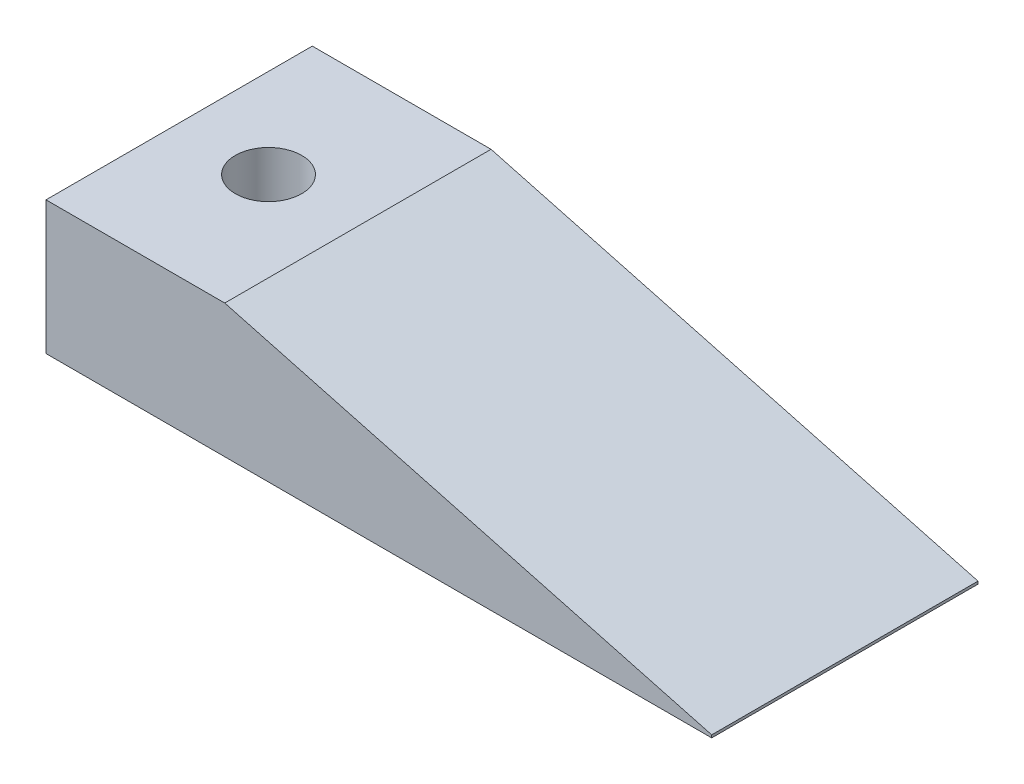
ISO-10303-21;
HEADER;
FILE_DESCRIPTION(('STEP AP214'),'2;1');
FILE_NAME('part.step','',(''),(''),'','','');
FILE_SCHEMA(('AUTOMOTIVE_DESIGN { 1 0 10303 214 1 1 1 1 }'));
ENDSEC;
DATA;
#1=APPLICATION_CONTEXT('core data for automotive mechanical design processes');
#2=APPLICATION_PROTOCOL_DEFINITION('international standard','automotive_design',2000,#1);
#3=PRODUCT_CONTEXT('',#1,'mechanical');
#4=PRODUCT('Part','Part','',(#3));
#5=PRODUCT_RELATED_PRODUCT_CATEGORY('part','',(#4));
#6=PRODUCT_DEFINITION_FORMATION('','',#4);
#7=PRODUCT_DEFINITION_CONTEXT('part definition',#1,'design');
#8=PRODUCT_DEFINITION('design','',#6,#7);
#9=PRODUCT_DEFINITION_SHAPE('','',#8);
#10=(LENGTH_UNIT() NAMED_UNIT(*) SI_UNIT(.MILLI.,.METRE.));
#11=(NAMED_UNIT(*) PLANE_ANGLE_UNIT() SI_UNIT($,.RADIAN.));
#12=(NAMED_UNIT(*) SI_UNIT($,.STERADIAN.) SOLID_ANGLE_UNIT());
#13=UNCERTAINTY_MEASURE_WITH_UNIT(LENGTH_MEASURE(1.E-05),#10,'distance_accuracy_value','');
#14=(GEOMETRIC_REPRESENTATION_CONTEXT(3) GLOBAL_UNCERTAINTY_ASSIGNED_CONTEXT((#13)) GLOBAL_UNIT_ASSIGNED_CONTEXT((#10,
#11,#12)) REPRESENTATION_CONTEXT('',''));
#15=CARTESIAN_POINT('',(0.,0.,0.));
#16=DIRECTION('',(0.,0.,1.));
#17=DIRECTION('',(1.,0.,0.));
#18=AXIS2_PLACEMENT_3D('',#15,#16,#17);
#19=CARTESIAN_POINT('',(0.,10.,10.));
#20=DIRECTION('',(0.,0.,-1.));
#21=DIRECTION('',(-1.,0.,0.));
#22=AXIS2_PLACEMENT_3D('',#19,#20,#21);
#23=PLANE('',#22);
#24=DIRECTION('',(0.965925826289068,-0.258819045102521,0.));
#25=VECTOR('',#24,1.);
#26=CARTESIAN_POINT('',(0.899364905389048,13.3564755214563,10.));
#27=LINE('',#26,#25);
#28=CARTESIAN_POINT('',(13.4259020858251,10.,9.99999999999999));
#29=VERTEX_POINT('',#28);
#30=CARTESIAN_POINT('',(50.,0.2,9.99999999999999));
#31=VERTEX_POINT('',#30);
#32=EDGE_CURVE('E95',#29,#31,#27,.T.);
#33=ORIENTED_EDGE('',*,*,#32,.F.);
#34=DIRECTION('',(1.,0.,0.));
#35=VECTOR('',#34,1.);
#36=CARTESIAN_POINT('',(0.,10.,10.));
#37=LINE('',#36,#35);
#38=CARTESIAN_POINT('',(0.,10.,10.));
#39=VERTEX_POINT('',#38);
#40=EDGE_CURVE('E110',#39,#29,#37,.T.);
#41=ORIENTED_EDGE('',*,*,#40,.F.);
#42=DIRECTION('',(0.,-1.,0.));
#43=VECTOR('',#42,1.);
#44=CARTESIAN_POINT('',(0.,10.,10.));
#45=LINE('',#44,#43);
#46=CARTESIAN_POINT('',(0.,0.,10.));
#47=VERTEX_POINT('',#46);
#48=EDGE_CURVE('E39',#39,#47,#45,.T.);
#49=ORIENTED_EDGE('',*,*,#48,.T.);
#50=DIRECTION('',(1.,0.,0.));
#51=VECTOR('',#50,1.);
#52=CARTESIAN_POINT('',(0.,0.,10.));
#53=LINE('',#52,#51);
#54=CARTESIAN_POINT('',(50.,0.,10.));
#55=VERTEX_POINT('',#54);
#56=EDGE_CURVE('E93',#47,#55,#53,.T.);
#57=ORIENTED_EDGE('',*,*,#56,.T.);
#58=DIRECTION('',(0.,-1.,0.));
#59=VECTOR('',#58,1.);
#60=CARTESIAN_POINT('',(50.,10.,10.));
#61=LINE('',#60,#59);
#62=EDGE_CURVE('E105',#31,#55,#61,.T.);
#63=ORIENTED_EDGE('',*,*,#62,.F.);
#64=EDGE_LOOP('',(#33,#41,#49,#57,#63));
#65=FACE_BOUND('',#64,.T.);
#66=ADVANCED_FACE('F31',(#65),#23,.F.);
#67=CARTESIAN_POINT('',(50.,10.,-10.));
#68=DIRECTION('',(-1.,0.,0.));
#69=DIRECTION('',(0.,0.,1.));
#70=AXIS2_PLACEMENT_3D('',#67,#68,#69);
#71=PLANE('',#70);
#72=DIRECTION('',(0.,0.,-1.));
#73=VECTOR('',#72,1.);
#74=CARTESIAN_POINT('',(50.,0.2,78.4653196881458));
#75=LINE('',#74,#73);
#76=CARTESIAN_POINT('',(50.,0.2,-9.99999999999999));
#77=VERTEX_POINT('',#76);
#78=EDGE_CURVE('E116',#31,#77,#75,.T.);
#79=ORIENTED_EDGE('',*,*,#78,.F.);
#80=ORIENTED_EDGE('',*,*,#62,.T.);
#81=DIRECTION('',(0.,0.,-1.));
#82=VECTOR('',#81,1.);
#83=CARTESIAN_POINT('',(50.,0.,-10.));
#84=LINE('',#83,#82);
#85=CARTESIAN_POINT('',(50.,0.,-10.));
#86=VERTEX_POINT('',#85);
#87=EDGE_CURVE('E84',#55,#86,#84,.T.);
#88=ORIENTED_EDGE('',*,*,#87,.T.);
#89=DIRECTION('',(0.,-1.,0.));
#90=VECTOR('',#89,1.);
#91=CARTESIAN_POINT('',(50.,10.,-10.));
#92=LINE('',#91,#90);
#93=EDGE_CURVE('E78',#77,#86,#92,.T.);
#94=ORIENTED_EDGE('',*,*,#93,.F.);
#95=EDGE_LOOP('',(#79,#80,#88,#94));
#96=FACE_BOUND('',#95,.T.);
#97=ADVANCED_FACE('F139',(#96),#71,.F.);
#98=CARTESIAN_POINT('',(0.,10.,-10.));
#99=DIRECTION('',(0.,0.,1.));
#100=DIRECTION('',(1.,0.,0.));
#101=AXIS2_PLACEMENT_3D('',#98,#99,#100);
#102=PLANE('',#101);
#103=DIRECTION('',(-0.965925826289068,0.258819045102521,0.));
#104=VECTOR('',#103,1.);
#105=CARTESIAN_POINT('',(0.899364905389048,13.3564755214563,-10.));
#106=LINE('',#105,#104);
#107=CARTESIAN_POINT('',(13.4259020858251,10.,-10.));
#108=VERTEX_POINT('',#107);
#109=EDGE_CURVE('E46',#77,#108,#106,.T.);
#110=ORIENTED_EDGE('',*,*,#109,.F.);
#111=ORIENTED_EDGE('',*,*,#93,.T.);
#112=DIRECTION('',(-1.,0.,0.));
#113=VECTOR('',#112,1.);
#114=CARTESIAN_POINT('',(0.,0.,-10.));
#115=LINE('',#114,#113);
#116=CARTESIAN_POINT('',(0.,0.,-10.));
#117=VERTEX_POINT('',#116);
#118=EDGE_CURVE('E72',#86,#117,#115,.T.);
#119=ORIENTED_EDGE('',*,*,#118,.T.);
#120=DIRECTION('',(0.,-1.,0.));
#121=VECTOR('',#120,1.);
#122=CARTESIAN_POINT('',(0.,10.,-10.));
#123=LINE('',#122,#121);
#124=CARTESIAN_POINT('',(0.,10.,-10.));
#125=VERTEX_POINT('',#124);
#126=EDGE_CURVE('E75',#125,#117,#123,.T.);
#127=ORIENTED_EDGE('',*,*,#126,.F.);
#128=DIRECTION('',(-1.,0.,0.));
#129=VECTOR('',#128,1.);
#130=CARTESIAN_POINT('',(0.,10.,-10.));
#131=LINE('',#130,#129);
#132=EDGE_CURVE('E53',#108,#125,#131,.T.);
#133=ORIENTED_EDGE('',*,*,#132,.F.);
#134=EDGE_LOOP('',(#110,#111,#119,#127,#133));
#135=FACE_BOUND('',#134,.T.);
#136=ADVANCED_FACE('F74',(#135),#102,.F.);
#137=CARTESIAN_POINT('',(0.,10.,10.));
#138=DIRECTION('',(0.,1.,0.));
#139=DIRECTION('',(0.,0.,1.));
#140=AXIS2_PLACEMENT_3D('',#137,#138,#139);
#141=PLANE('',#140);
#142=CARTESIAN_POINT('',(6.71295104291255,10.,0.));
#143=DIRECTION('',(0.,1.,0.));
#144=DIRECTION('',(0.,0.,1.));
#145=AXIS2_PLACEMENT_3D('',#142,#143,#144);
#146=CIRCLE('',#145,2.49388059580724);
#147=CARTESIAN_POINT('',(6.71295104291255,10.,2.49388059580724));
#148=VERTEX_POINT('',#147);
#149=EDGE_CURVE('E119',#148,#148,#146,.T.);
#150=ORIENTED_EDGE('',*,*,#149,.F.);
#151=EDGE_LOOP('',(#150));
#152=FACE_BOUND('',#151,.T.);
#153=ORIENTED_EDGE('',*,*,#40,.T.);
#154=DIRECTION('',(0.,0.,-1.));
#155=VECTOR('',#154,1.);
#156=CARTESIAN_POINT('',(13.4259020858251,10.,10.));
#157=LINE('',#156,#155);
#158=EDGE_CURVE('E11',#29,#108,#157,.T.);
#159=ORIENTED_EDGE('',*,*,#158,.T.);
#160=ORIENTED_EDGE('',*,*,#132,.T.);
#161=DIRECTION('',(0.,0.,1.));
#162=VECTOR('',#161,1.);
#163=CARTESIAN_POINT('',(0.,10.,-10.));
#164=LINE('',#163,#162);
#165=EDGE_CURVE('E83',#125,#39,#164,.T.);
#166=ORIENTED_EDGE('',*,*,#165,.T.);
#167=EDGE_LOOP('',(#153,#159,#160,#166));
#168=FACE_BOUND('',#167,.T.);
#169=ADVANCED_FACE('F112',(#152,#168),#141,.T.);
#170=CARTESIAN_POINT('',(0.,10.,-10.));
#171=DIRECTION('',(1.,0.,0.));
#172=DIRECTION('',(0.,0.,-1.));
#173=AXIS2_PLACEMENT_3D('',#170,#171,#172);
#174=PLANE('',#173);
#175=DIRECTION('',(0.,0.,1.));
#176=VECTOR('',#175,1.);
#177=CARTESIAN_POINT('',(0.,0.,-10.));
#178=LINE('',#177,#176);
#179=EDGE_CURVE('E89',#117,#47,#178,.T.);
#180=ORIENTED_EDGE('',*,*,#179,.T.);
#181=ORIENTED_EDGE('',*,*,#48,.F.);
#182=ORIENTED_EDGE('',*,*,#165,.F.);
#183=ORIENTED_EDGE('',*,*,#126,.T.);
#184=EDGE_LOOP('',(#180,#181,#182,#183));
#185=FACE_BOUND('',#184,.T.);
#186=ADVANCED_FACE('F33',(#185),#174,.F.);
#187=CARTESIAN_POINT('',(0.,0.,10.));
#188=DIRECTION('',(0.,1.,0.));
#189=DIRECTION('',(0.,0.,1.));
#190=AXIS2_PLACEMENT_3D('',#187,#188,#189);
#191=PLANE('',#190);
#192=CARTESIAN_POINT('',(6.71295104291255,0.,0.));
#193=DIRECTION('',(0.,1.,0.));
#194=DIRECTION('',(0.,0.,1.));
#195=AXIS2_PLACEMENT_3D('',#192,#193,#194);
#196=CIRCLE('',#195,2.49388059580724);
#197=CARTESIAN_POINT('',(6.71295104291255,0.,2.49388059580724));
#198=VERTEX_POINT('',#197);
#199=EDGE_CURVE('E118',#198,#198,#196,.T.);
#200=ORIENTED_EDGE('',*,*,#199,.T.);
#201=EDGE_LOOP('',(#200));
#202=FACE_BOUND('',#201,.T.);
#203=ORIENTED_EDGE('',*,*,#179,.F.);
#204=ORIENTED_EDGE('',*,*,#118,.F.);
#205=ORIENTED_EDGE('',*,*,#87,.F.);
#206=ORIENTED_EDGE('',*,*,#56,.F.);
#207=EDGE_LOOP('',(#203,#204,#205,#206));
#208=FACE_BOUND('',#207,.T.);
#209=ADVANCED_FACE('F91',(#202,#208),#191,.F.);
#210=CARTESIAN_POINT('',(13.4259020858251,10.,78.4653196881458));
#211=DIRECTION('',(0.258819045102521,0.965925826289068,0.));
#212=DIRECTION('',(-0.965925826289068,0.258819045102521,0.));
#213=AXIS2_PLACEMENT_3D('',#210,#211,#212);
#214=PLANE('',#213);
#215=ORIENTED_EDGE('',*,*,#158,.F.);
#216=ORIENTED_EDGE('',*,*,#32,.T.);
#217=ORIENTED_EDGE('',*,*,#78,.T.);
#218=ORIENTED_EDGE('',*,*,#109,.T.);
#219=EDGE_LOOP('',(#215,#216,#217,#218));
#220=FACE_BOUND('',#219,.T.);
#221=ADVANCED_FACE('F129',(#220),#214,.T.);
#222=CARTESIAN_POINT('',(6.71295104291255,0.,0.));
#223=DIRECTION('',(0.,1.,0.));
#224=DIRECTION('',(0.,0.,1.));
#225=AXIS2_PLACEMENT_3D('',#222,#223,#224);
#226=CYLINDRICAL_SURFACE('',#225,2.49388059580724);
#227=ORIENTED_EDGE('',*,*,#199,.F.);
#228=EDGE_LOOP('',(#227));
#229=FACE_BOUND('',#228,.T.);
#230=ORIENTED_EDGE('',*,*,#149,.T.);
#231=EDGE_LOOP('',(#230));
#232=FACE_BOUND('',#231,.T.);
#233=ADVANCED_FACE('F126',(#229,#232),#226,.F.);
#234=CLOSED_SHELL('',(#66,#97,#136,#169,#186,#209,#221,#233));
#235=MANIFOLD_SOLID_BREP('B2',#234);
#236=ADVANCED_BREP_SHAPE_REPRESENTATION('',(#18,#235),#14);
#237=SHAPE_DEFINITION_REPRESENTATION(#9,#236);
ENDSEC;
END-ISO-10303-21;
